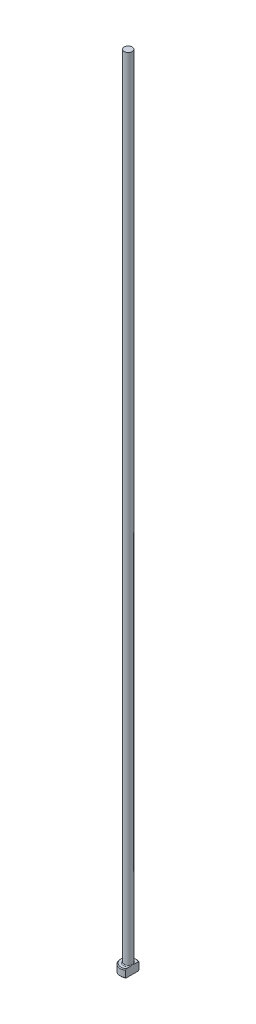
ISO-10303-21;
HEADER;
FILE_DESCRIPTION(('STEP AP214'),'2;1');
FILE_NAME('part.step','',(''),(''),'','','');
FILE_SCHEMA(('AUTOMOTIVE_DESIGN { 1 0 10303 214 1 1 1 1 }'));
ENDSEC;
DATA;
#1=APPLICATION_CONTEXT('core data for automotive mechanical design processes');
#2=APPLICATION_PROTOCOL_DEFINITION('international standard','automotive_design',2000,#1);
#3=PRODUCT_CONTEXT('',#1,'mechanical');
#4=PRODUCT('Part','Part','',(#3));
#5=PRODUCT_RELATED_PRODUCT_CATEGORY('part','',(#4));
#6=PRODUCT_DEFINITION_FORMATION('','',#4);
#7=PRODUCT_DEFINITION_CONTEXT('part definition',#1,'design');
#8=PRODUCT_DEFINITION('design','',#6,#7);
#9=PRODUCT_DEFINITION_SHAPE('','',#8);
#10=(LENGTH_UNIT() NAMED_UNIT(*) SI_UNIT(.MILLI.,.METRE.));
#11=(NAMED_UNIT(*) PLANE_ANGLE_UNIT() SI_UNIT($,.RADIAN.));
#12=(NAMED_UNIT(*) SI_UNIT($,.STERADIAN.) SOLID_ANGLE_UNIT());
#13=UNCERTAINTY_MEASURE_WITH_UNIT(LENGTH_MEASURE(1.E-05),#10,'distance_accuracy_value','');
#14=(GEOMETRIC_REPRESENTATION_CONTEXT(3) GLOBAL_UNCERTAINTY_ASSIGNED_CONTEXT((#13)) GLOBAL_UNIT_ASSIGNED_CONTEXT((#10,
#11,#12)) REPRESENTATION_CONTEXT('',''));
#15=CARTESIAN_POINT('',(0.,0.,0.));
#16=DIRECTION('',(0.,0.,1.));
#17=DIRECTION('',(1.,0.,0.));
#18=AXIS2_PLACEMENT_3D('',#15,#16,#17);
#19=CARTESIAN_POINT('',(0.,0.,0.));
#20=DIRECTION('',(0.,-1.,0.));
#21=DIRECTION('',(0.,0.,-1.));
#22=AXIS2_PLACEMENT_3D('',#19,#20,#21);
#23=PLANE('',#22);
#24=CARTESIAN_POINT('',(0.,0.,0.));
#25=DIRECTION('',(0.,-1.,0.));
#26=DIRECTION('',(0.,0.,-1.));
#27=AXIS2_PLACEMENT_3D('',#24,#25,#26);
#28=CIRCLE('',#27,1.8);
#29=CARTESIAN_POINT('',(0.999999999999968,0.,1.49666295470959));
#30=VERTEX_POINT('',#29);
#31=CARTESIAN_POINT('',(0.999999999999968,0.,-1.49666295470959));
#32=VERTEX_POINT('',#31);
#33=EDGE_CURVE('E98',#30,#32,#28,.T.);
#34=ORIENTED_EDGE('',*,*,#33,.T.);
#35=DIRECTION('',(0.,0.,1.));
#36=VECTOR('',#35,1.);
#37=CARTESIAN_POINT('',(0.999999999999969,0.,-1.73205080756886));
#38=LINE('',#37,#36);
#39=EDGE_CURVE('E83',#32,#30,#38,.T.);
#40=ORIENTED_EDGE('',*,*,#39,.T.);
#41=EDGE_LOOP('',(#34,#40));
#42=FACE_BOUND('',#41,.T.);
#43=ADVANCED_FACE('F32',(#42),#23,.T.);
#44=CARTESIAN_POINT('',(0.,259.958771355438,0.));
#45=DIRECTION('',(0.,1.,0.));
#46=DIRECTION('',(0.,0.,1.));
#47=AXIS2_PLACEMENT_3D('',#44,#45,#46);
#48=CYLINDRICAL_SURFACE('',#47,1.99999999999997);
#49=CARTESIAN_POINT('',(0.,1.80000000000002,0.));
#50=DIRECTION('',(0.,1.,0.));
#51=DIRECTION('',(0.,0.,1.));
#52=AXIS2_PLACEMENT_3D('',#49,#50,#51);
#53=CIRCLE('',#52,1.99999999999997);
#54=CARTESIAN_POINT('',(0.999999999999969,1.80000000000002,1.73205080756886));
#55=VERTEX_POINT('',#54);
#56=CARTESIAN_POINT('',(0.999999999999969,1.80000000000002,-1.73205080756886));
#57=VERTEX_POINT('',#56);
#58=EDGE_CURVE('E104',#55,#57,#53,.F.);
#59=ORIENTED_EDGE('',*,*,#58,.T.);
#60=DIRECTION('',(0.,-1.,0.));
#61=VECTOR('',#60,1.);
#62=CARTESIAN_POINT('',(0.999999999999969,200.,-1.73205080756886));
#63=LINE('',#62,#61);
#64=CARTESIAN_POINT('',(0.999999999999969,0.199999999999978,-1.73205080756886));
#65=VERTEX_POINT('',#64);
#66=EDGE_CURVE('E183',#57,#65,#63,.T.);
#67=ORIENTED_EDGE('',*,*,#66,.T.);
#68=CARTESIAN_POINT('',(0.,0.199999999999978,0.));
#69=DIRECTION('',(0.,-1.,0.));
#70=DIRECTION('',(0.,0.,-1.));
#71=AXIS2_PLACEMENT_3D('',#68,#69,#70);
#72=CIRCLE('',#71,1.99999999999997);
#73=CARTESIAN_POINT('',(0.999999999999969,0.199999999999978,1.73205080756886));
#74=VERTEX_POINT('',#73);
#75=EDGE_CURVE('E100',#65,#74,#72,.F.);
#76=ORIENTED_EDGE('',*,*,#75,.T.);
#77=DIRECTION('',(0.,-1.,0.));
#78=VECTOR('',#77,1.);
#79=CARTESIAN_POINT('',(0.999999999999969,200.,1.73205080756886));
#80=LINE('',#79,#78);
#81=EDGE_CURVE('E93',#55,#74,#80,.T.);
#82=ORIENTED_EDGE('',*,*,#81,.F.);
#83=EDGE_LOOP('',(#59,#67,#76,#82));
#84=FACE_BOUND('',#83,.T.);
#85=ADVANCED_FACE('F158',(#84),#48,.T.);
#86=CARTESIAN_POINT('',(-1.99999999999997,2.,0.));
#87=DIRECTION('',(0.,1.,0.));
#88=DIRECTION('',(0.,0.,1.));
#89=AXIS2_PLACEMENT_3D('',#86,#87,#88);
#90=PLANE('',#89);
#91=CARTESIAN_POINT('',(0.,2.,0.));
#92=DIRECTION('',(0.,1.,0.));
#93=DIRECTION('',(0.,0.,1.));
#94=AXIS2_PLACEMENT_3D('',#91,#92,#93);
#95=CIRCLE('',#94,1.8);
#96=CARTESIAN_POINT('',(0.999999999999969,2.,-1.4966629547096));
#97=VERTEX_POINT('',#96);
#98=CARTESIAN_POINT('',(0.999999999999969,2.,1.4966629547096));
#99=VERTEX_POINT('',#98);
#100=EDGE_CURVE('E178',#97,#99,#95,.T.);
#101=ORIENTED_EDGE('',*,*,#100,.T.);
#102=DIRECTION('',(0.,0.,-1.));
#103=VECTOR('',#102,1.);
#104=CARTESIAN_POINT('',(0.999999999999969,2.,0.));
#105=LINE('',#104,#103);
#106=CARTESIAN_POINT('',(0.999999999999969,1.99999999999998,0.66332495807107));
#107=VERTEX_POINT('',#106);
#108=EDGE_CURVE('E57',#99,#107,#105,.T.);
#109=ORIENTED_EDGE('',*,*,#108,.T.);
#110=CARTESIAN_POINT('',(0.,2.,0.));
#111=DIRECTION('',(0.,1.,0.));
#112=DIRECTION('',(0.,0.,1.));
#113=AXIS2_PLACEMENT_3D('',#110,#111,#112);
#114=CIRCLE('',#113,1.19999999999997);
#115=CARTESIAN_POINT('',(0.999999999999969,1.99999999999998,-0.663324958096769));
#116=VERTEX_POINT('',#115);
#117=EDGE_CURVE('E107',#107,#116,#114,.F.);
#118=ORIENTED_EDGE('',*,*,#117,.T.);
#119=EDGE_CURVE('E136',#116,#97,#105,.T.);
#120=ORIENTED_EDGE('',*,*,#119,.T.);
#121=EDGE_LOOP('',(#101,#109,#118,#120));
#122=FACE_BOUND('',#121,.T.);
#123=ADVANCED_FACE('F147',(#122),#90,.T.);
#124=CARTESIAN_POINT('',(0.,2.,0.));
#125=DIRECTION('',(0.,-1.,0.));
#126=DIRECTION('',(0.,0.,-1.));
#127=AXIS2_PLACEMENT_3D('',#124,#125,#126);
#128=CONICAL_SURFACE('',#127,1.8,0.785398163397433);
#129=ORIENTED_EDGE('',*,*,#58,.F.);
#130=CARTESIAN_POINT('',(0.999999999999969,-0.143084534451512,3.81417299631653));
#131=CARTESIAN_POINT('',(0.999999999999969,-0.0593997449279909,3.72765647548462));
#132=CARTESIAN_POINT('',(0.999999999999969,0.0241940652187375,3.64105173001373));
#133=CARTESIAN_POINT('',(0.999999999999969,0.191148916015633,3.46761616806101));
#134=CARTESIAN_POINT('',(0.999999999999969,0.274509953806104,3.38078534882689));
#135=CARTESIAN_POINT('',(0.999999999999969,0.524249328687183,3.11979400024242));
#136=CARTESIAN_POINT('',(0.999999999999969,0.690198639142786,2.94522254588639));
#137=CARTESIAN_POINT('',(0.999999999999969,1.016975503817,2.59782670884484));
#138=CARTESIAN_POINT('',(0.999999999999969,1.17783928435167,2.42503661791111));
#139=CARTESIAN_POINT('',(0.999999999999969,1.41669118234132,2.16364984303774));
#140=CARTESIAN_POINT('',(0.999999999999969,1.49589273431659,2.07616357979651));
#141=CARTESIAN_POINT('',(0.999999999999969,1.65313803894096,1.90015721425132));
#142=CARTESIAN_POINT('',(0.999999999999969,1.73118183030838,1.81163714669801));
#143=CARTESIAN_POINT('',(0.999999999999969,1.85567318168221,1.66767927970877));
#144=CARTESIAN_POINT('',(0.999999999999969,1.90265415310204,1.61270332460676));
#145=CARTESIAN_POINT('',(0.999999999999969,1.99577882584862,1.50203557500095));
#146=CARTESIAN_POINT('',(0.999999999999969,2.04192244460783,1.44634371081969));
#147=CARTESIAN_POINT('',(0.999999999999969,2.1335659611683,1.33345480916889));
#148=CARTESIAN_POINT('',(0.999999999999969,2.17905399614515,1.2762481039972));
#149=CARTESIAN_POINT('',(0.999999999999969,2.26844283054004,1.16060976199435));
#150=CARTESIAN_POINT('',(0.999999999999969,2.31234379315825,1.10217825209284));
#151=CARTESIAN_POINT('',(0.999999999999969,2.39853453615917,0.982773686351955));
#152=CARTESIAN_POINT('',(0.999999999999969,2.44078986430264,0.921775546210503));
#153=CARTESIAN_POINT('',(0.999999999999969,2.52187810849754,0.797387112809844));
#154=CARTESIAN_POINT('',(0.999999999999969,2.56070631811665,0.733993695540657));
#155=CARTESIAN_POINT('',(0.999999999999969,2.63248592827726,0.604932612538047));
#156=CARTESIAN_POINT('',(0.999999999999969,2.66550424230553,0.539302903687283));
#157=CARTESIAN_POINT('',(0.999999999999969,2.72301550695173,0.404437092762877));
#158=CARTESIAN_POINT('',(0.999999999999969,2.74753707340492,0.335214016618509));
#159=CARTESIAN_POINT('',(0.999999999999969,2.77407110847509,0.231400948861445));
#160=CARTESIAN_POINT('',(0.999999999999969,2.7811074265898,0.198093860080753));
#161=CARTESIAN_POINT('',(0.999999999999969,2.79200506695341,0.130954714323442));
#162=CARTESIAN_POINT('',(0.999999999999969,2.79586666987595,0.0971227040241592));
#163=CARTESIAN_POINT('',(0.999999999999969,2.8001390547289,0.0293410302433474));
#164=CARTESIAN_POINT('',(0.999999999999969,2.80056046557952,-0.00460794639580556));
#165=CARTESIAN_POINT('',(0.999999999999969,2.79795882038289,-0.0723663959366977));
#166=CARTESIAN_POINT('',(0.999999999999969,2.79493547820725,-0.106175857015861));
#167=CARTESIAN_POINT('',(0.999999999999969,2.78105481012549,-0.206326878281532));
#168=CARTESIAN_POINT('',(0.999999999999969,2.7654214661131,-0.272037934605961));
#169=CARTESIAN_POINT('',(0.999999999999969,2.73477554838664,-0.368312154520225));
#170=CARTESIAN_POINT('',(0.999999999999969,2.72331063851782,-0.40012349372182));
#171=CARTESIAN_POINT('',(0.999999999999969,2.69840546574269,-0.46296441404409));
#172=CARTESIAN_POINT('',(0.999999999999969,2.68496560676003,-0.493994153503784));
#173=CARTESIAN_POINT('',(0.999999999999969,2.64209309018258,-0.586298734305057));
#174=CARTESIAN_POINT('',(0.999999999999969,2.61022871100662,-0.64643570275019));
#175=CARTESIAN_POINT('',(0.999999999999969,2.54228534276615,-0.764304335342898));
#176=CARTESIAN_POINT('',(0.999999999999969,2.50620119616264,-0.8220329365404));
#177=CARTESIAN_POINT('',(0.999999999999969,2.43107084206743,-0.935840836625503));
#178=CARTESIAN_POINT('',(0.999999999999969,2.39201347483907,-0.991912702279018));
#179=CARTESIAN_POINT('',(0.999999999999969,2.31195870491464,-1.10259849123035));
#180=CARTESIAN_POINT('',(0.999999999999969,2.27096226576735,-1.15721311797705));
#181=CARTESIAN_POINT('',(0.999999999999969,2.18701695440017,-1.26606869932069));
#182=CARTESIAN_POINT('',(0.999999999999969,2.14404946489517,-1.32029522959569));
#183=CARTESIAN_POINT('',(0.999999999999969,2.05705050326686,-1.4278898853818));
#184=CARTESIAN_POINT('',(0.999999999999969,2.01301896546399,-1.48125795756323));
#185=CARTESIAN_POINT('',(0.999999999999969,1.87995068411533,-1.64010952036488));
#186=CARTESIAN_POINT('',(0.999999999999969,1.78973357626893,-1.74460261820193));
#187=CARTESIAN_POINT('',(0.999999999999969,1.62290341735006,-1.93426834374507));
#188=CARTESIAN_POINT('',(0.999999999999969,1.54658658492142,-2.01970404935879));
#189=CARTESIAN_POINT('',(0.999999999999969,1.39301250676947,-2.18973019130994));
#190=CARTESIAN_POINT('',(0.999999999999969,1.31575523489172,-2.27432060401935));
#191=CARTESIAN_POINT('',(0.999999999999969,1.08283440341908,-2.52732479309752));
#192=CARTESIAN_POINT('',(0.999999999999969,0.926165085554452,-2.69481086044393));
#193=CARTESIAN_POINT('',(0.999999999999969,0.617772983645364,-3.02147252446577));
#194=CARTESIAN_POINT('',(0.999999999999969,0.466111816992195,-3.18070657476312));
#195=CARTESIAN_POINT('',(0.999999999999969,0.238015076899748,-3.41880818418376));
#196=CARTESIAN_POINT('',(0.999999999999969,0.161924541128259,-3.49800657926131));
#197=CARTESIAN_POINT('',(0.999999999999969,0.00955322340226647,-3.65621892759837));
#198=CARTESIAN_POINT('',(0.999999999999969,-0.0667275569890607,-3.73523288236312));
#199=CARTESIAN_POINT('',(0.999999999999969,-0.143084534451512,-3.81417299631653));
#200=B_SPLINE_CURVE_WITH_KNOTS('',3,(#130,#131,#132,#133,#134,#135,#136,#137,#138,#139,#140,
#141,#142,#143,#144,#145,#146,#147,#148,#149,#150,#151,#152,#153,#154,#155,#156,#157,#158,#159,
#160,#161,#162,#163,#164,#165,#166,#167,#168,#169,#170,#171,#172,#173,#174,#175,#176,#177,#178,
#179,#180,#181,#182,#183,#184,#185,#186,#187,#188,#189,#190,#191,#192,#193,#194,#195,#196,#197,
#198,#199),.UNSPECIFIED.,.F.,.F.,(4,2,2,2,2,2,2,2,2,2,2,2,2,2,2,2,2,2,2,2,2,2,2,2,2,2,2,2,2,2,2,
2,2,2,4),(0.,0.361101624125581,0.722207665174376,1.44478731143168,2.15299784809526,
2.5070263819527,2.8610430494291,3.07798416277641,3.29494655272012,3.51418925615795,
3.73340935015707,3.95594813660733,4.17878792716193,4.39886399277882,4.61819150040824,
4.72018864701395,4.82217677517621,4.92384967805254,5.02553102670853,5.22698459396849,
5.32838854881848,5.4297717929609,5.63365200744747,5.837784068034,6.04272417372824,
6.24756349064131,6.45510395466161,6.66265726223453,7.07676259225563,7.42043039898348,
7.7641077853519,8.45210822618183,9.1118082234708,9.44129145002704,9.77077197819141),.UNSPECIFIED.);
#201=EDGE_CURVE('E135',#55,#99,#200,.T.);
#202=ORIENTED_EDGE('',*,*,#201,.T.);
#203=ORIENTED_EDGE('',*,*,#100,.F.);
#204=EDGE_CURVE('E127',#97,#57,#200,.T.);
#205=ORIENTED_EDGE('',*,*,#204,.T.);
#206=EDGE_LOOP('',(#129,#202,#203,#205));
#207=FACE_BOUND('',#206,.T.);
#208=ADVANCED_FACE('F143',(#207),#128,.T.);
#209=CARTESIAN_POINT('',(0.,0.199999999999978,0.));
#210=DIRECTION('',(0.,1.,0.));
#211=DIRECTION('',(0.,0.,1.));
#212=AXIS2_PLACEMENT_3D('',#209,#210,#211);
#213=CONICAL_SURFACE('',#212,1.99999999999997,0.785398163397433);
#214=ORIENTED_EDGE('',*,*,#75,.F.);
#215=CARTESIAN_POINT('',(0.999999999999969,2.14308453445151,-3.81417299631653));
#216=CARTESIAN_POINT('',(0.999999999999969,2.05939974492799,-3.72765647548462));
#217=CARTESIAN_POINT('',(0.999999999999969,1.97580593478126,-3.64105173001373));
#218=CARTESIAN_POINT('',(0.999999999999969,1.80885108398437,-3.46761616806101));
#219=CARTESIAN_POINT('',(0.999999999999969,1.7254900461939,-3.38078534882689));
#220=CARTESIAN_POINT('',(0.999999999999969,1.47575067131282,-3.11979400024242));
#221=CARTESIAN_POINT('',(0.999999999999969,1.30980136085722,-2.94522254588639));
#222=CARTESIAN_POINT('',(0.999999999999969,0.983024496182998,-2.59782670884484));
#223=CARTESIAN_POINT('',(0.999999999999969,0.822160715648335,-2.42503661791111));
#224=CARTESIAN_POINT('',(0.999999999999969,0.583308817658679,-2.16364984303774));
#225=CARTESIAN_POINT('',(0.999999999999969,0.504107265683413,-2.07616357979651));
#226=CARTESIAN_POINT('',(0.999999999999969,0.346861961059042,-1.90015721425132));
#227=CARTESIAN_POINT('',(0.999999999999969,0.268818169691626,-1.81163714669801));
#228=CARTESIAN_POINT('',(0.999999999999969,0.144326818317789,-1.66767927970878));
#229=CARTESIAN_POINT('',(0.999999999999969,0.0973458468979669,-1.61270332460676));
#230=CARTESIAN_POINT('',(0.999999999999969,0.00422117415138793,-1.50203557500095));
#231=CARTESIAN_POINT('',(0.999999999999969,-0.0419224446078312,-1.44634371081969));
#232=CARTESIAN_POINT('',(0.999999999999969,-0.133565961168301,-1.3334548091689));
#233=CARTESIAN_POINT('',(0.999999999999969,-0.179053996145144,-1.2762481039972));
#234=CARTESIAN_POINT('',(0.999999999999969,-0.268442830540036,-1.16060976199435));
#235=CARTESIAN_POINT('',(0.999999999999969,-0.312343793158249,-1.10217825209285));
#236=CARTESIAN_POINT('',(0.999999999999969,-0.398534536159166,-0.982773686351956));
#237=CARTESIAN_POINT('',(0.999999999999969,-0.440789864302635,-0.921775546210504));
#238=CARTESIAN_POINT('',(0.999999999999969,-0.521878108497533,-0.797387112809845));
#239=CARTESIAN_POINT('',(0.999999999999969,-0.560706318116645,-0.733993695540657));
#240=CARTESIAN_POINT('',(0.999999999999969,-0.632485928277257,-0.604932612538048));
#241=CARTESIAN_POINT('',(0.999999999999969,-0.665504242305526,-0.539302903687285));
#242=CARTESIAN_POINT('',(0.999999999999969,-0.723015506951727,-0.404437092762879));
#243=CARTESIAN_POINT('',(0.999999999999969,-0.747537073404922,-0.33521401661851));
#244=CARTESIAN_POINT('',(0.999999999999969,-0.774071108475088,-0.231400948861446));
#245=CARTESIAN_POINT('',(0.999999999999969,-0.781107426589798,-0.198093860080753));
#246=CARTESIAN_POINT('',(0.999999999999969,-0.792005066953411,-0.130954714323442));
#247=CARTESIAN_POINT('',(0.999999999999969,-0.795866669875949,-0.0971227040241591));
#248=CARTESIAN_POINT('',(0.999999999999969,-0.8001390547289,-0.0293410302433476));
#249=CARTESIAN_POINT('',(0.999999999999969,-0.800560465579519,0.00460794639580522));
#250=CARTESIAN_POINT('',(0.999999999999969,-0.797958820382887,0.0723663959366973));
#251=CARTESIAN_POINT('',(0.999999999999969,-0.794935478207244,0.106175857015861));
#252=CARTESIAN_POINT('',(0.999999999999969,-0.78105481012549,0.206326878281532));
#253=CARTESIAN_POINT('',(0.999999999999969,-0.765421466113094,0.272037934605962));
#254=CARTESIAN_POINT('',(0.999999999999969,-0.734775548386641,0.368312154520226));
#255=CARTESIAN_POINT('',(0.999999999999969,-0.723310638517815,0.400123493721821));
#256=CARTESIAN_POINT('',(0.999999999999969,-0.698405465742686,0.46296441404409));
#257=CARTESIAN_POINT('',(0.999999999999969,-0.684965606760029,0.493994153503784));
#258=CARTESIAN_POINT('',(0.999999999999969,-0.642093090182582,0.586298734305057));
#259=CARTESIAN_POINT('',(0.999999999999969,-0.610228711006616,0.64643570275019));
#260=CARTESIAN_POINT('',(0.999999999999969,-0.542285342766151,0.764304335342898));
#261=CARTESIAN_POINT('',(0.999999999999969,-0.506201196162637,0.8220329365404));
#262=CARTESIAN_POINT('',(0.999999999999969,-0.431070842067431,0.935840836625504));
#263=CARTESIAN_POINT('',(0.999999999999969,-0.392013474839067,0.991912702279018));
#264=CARTESIAN_POINT('',(0.999999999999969,-0.311958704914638,1.10259849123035));
#265=CARTESIAN_POINT('',(0.999999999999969,-0.270962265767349,1.15721311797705));
#266=CARTESIAN_POINT('',(0.999999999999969,-0.187016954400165,1.26606869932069));
#267=CARTESIAN_POINT('',(0.999999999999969,-0.144049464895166,1.32029522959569));
#268=CARTESIAN_POINT('',(0.999999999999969,-0.0570505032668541,1.4278898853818));
#269=CARTESIAN_POINT('',(0.999999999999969,-0.0130189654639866,1.48125795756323));
#270=CARTESIAN_POINT('',(0.999999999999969,0.120049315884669,1.64010952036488));
#271=CARTESIAN_POINT('',(0.999999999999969,0.210266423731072,1.74460261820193));
#272=CARTESIAN_POINT('',(0.999999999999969,0.377096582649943,1.93426834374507));
#273=CARTESIAN_POINT('',(0.999999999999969,0.453413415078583,2.01970404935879));
#274=CARTESIAN_POINT('',(0.999999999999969,0.60698749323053,2.18973019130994));
#275=CARTESIAN_POINT('',(0.999999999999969,0.684244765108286,2.27432060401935));
#276=CARTESIAN_POINT('',(0.999999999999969,0.917165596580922,2.52732479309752));
#277=CARTESIAN_POINT('',(0.999999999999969,1.07383491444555,2.69481086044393));
#278=CARTESIAN_POINT('',(0.999999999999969,1.38222701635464,3.02147252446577));
#279=CARTESIAN_POINT('',(0.999999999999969,1.53388818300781,3.18070657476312));
#280=CARTESIAN_POINT('',(0.999999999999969,1.76198492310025,3.41880818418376));
#281=CARTESIAN_POINT('',(0.999999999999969,1.83807545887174,3.49800657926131));
#282=CARTESIAN_POINT('',(0.999999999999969,1.99044677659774,3.65621892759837));
#283=CARTESIAN_POINT('',(0.999999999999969,2.06672755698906,3.73523288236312));
#284=CARTESIAN_POINT('',(0.999999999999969,2.14308453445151,3.81417299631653));
#285=B_SPLINE_CURVE_WITH_KNOTS('',3,(#215,#216,#217,#218,#219,#220,#221,#222,#223,#224,#225,
#226,#227,#228,#229,#230,#231,#232,#233,#234,#235,#236,#237,#238,#239,#240,#241,#242,#243,#244,
#245,#246,#247,#248,#249,#250,#251,#252,#253,#254,#255,#256,#257,#258,#259,#260,#261,#262,#263,
#264,#265,#266,#267,#268,#269,#270,#271,#272,#273,#274,#275,#276,#277,#278,#279,#280,#281,#282,
#283,#284),.UNSPECIFIED.,.F.,.F.,(4,2,2,2,2,2,2,2,2,2,2,2,2,2,2,2,2,2,2,2,2,2,2,2,2,2,2,2,2,2,2,
2,2,2,4),(0.,0.36110162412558,0.722207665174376,1.44478731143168,2.15299784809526,
2.5070263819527,2.8610430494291,3.07798416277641,3.29494655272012,3.51418925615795,
3.73340935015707,3.95594813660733,4.17878792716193,4.39886399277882,4.61819150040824,
4.72018864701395,4.82217677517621,4.92384967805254,5.02553102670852,5.22698459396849,
5.32838854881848,5.42977179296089,5.63365200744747,5.83778406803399,6.04272417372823,
6.24756349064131,6.45510395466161,6.66265726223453,7.07676259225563,7.42043039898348,
7.7641077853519,8.45210822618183,9.1118082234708,9.44129145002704,9.77077197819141),.UNSPECIFIED.);
#286=EDGE_CURVE('E86',#65,#32,#285,.T.);
#287=ORIENTED_EDGE('',*,*,#286,.T.);
#288=ORIENTED_EDGE('',*,*,#33,.F.);
#289=EDGE_CURVE('E89',#30,#74,#285,.T.);
#290=ORIENTED_EDGE('',*,*,#289,.T.);
#291=EDGE_LOOP('',(#214,#287,#288,#290));
#292=FACE_BOUND('',#291,.T.);
#293=ADVANCED_FACE('F97',(#292),#213,.T.);
#294=CARTESIAN_POINT('',(0.,2.19999999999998,0.));
#295=DIRECTION('',(0.,1.,0.));
#296=DIRECTION('',(0.,0.,1.));
#297=AXIS2_PLACEMENT_3D('',#294,#295,#296);
#298=TOROIDAL_SURFACE('',#297,1.19999999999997,0.2);
#299=CARTESIAN_POINT('',(0.999999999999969,2.19999999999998,0.));
#300=CARTESIAN_POINT('',(0.999999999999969,2.20000051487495,2.59081815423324E-12));
#301=CARTESIAN_POINT('',(0.999999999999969,2.20000102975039,-9.42496323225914E-08));
#302=CARTESIAN_POINT('',(0.999999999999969,2.20000202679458,-4.00799840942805E-07));
#303=CARTESIAN_POINT('',(0.999999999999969,2.20000250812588,-6.15372267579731E-07));
#304=CARTESIAN_POINT('',(0.999999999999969,2.20000346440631,-1.13351400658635E-06));
#305=CARTESIAN_POINT('',(0.999999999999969,2.20000393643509,-1.44235223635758E-06));
#306=CARTESIAN_POINT('',(0.999999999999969,2.20000483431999,-2.11388874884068E-06));
#307=CARTESIAN_POINT('',(0.999999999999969,2.20000526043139,-2.47625950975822E-06));
#308=CARTESIAN_POINT('',(0.999999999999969,2.20000666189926,-3.75794155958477E-06));
#309=CARTESIAN_POINT('',(0.999999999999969,2.20000757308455,-4.74818954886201E-06));
#310=CARTESIAN_POINT('',(0.999999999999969,2.2000092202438,-6.81289830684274E-06));
#311=CARTESIAN_POINT('',(0.999999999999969,2.20000996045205,-7.88417644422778E-06));
#312=CARTESIAN_POINT('',(0.999999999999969,2.20001267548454,-1.19907293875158E-05));
#313=CARTESIAN_POINT('',(0.999999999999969,2.20001450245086,-1.51274184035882E-05));
#314=CARTESIAN_POINT('',(0.999999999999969,2.20001755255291,-2.13715425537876E-05));
#315=CARTESIAN_POINT('',(0.999999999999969,2.20001881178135,-2.44620176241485E-05));
#316=CARTESIAN_POINT('',(0.999999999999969,2.20002404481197,-3.74145208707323E-05));
#317=CARTESIAN_POINT('',(0.999999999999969,2.20002793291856,-4.73052124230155E-05));
#318=CARTESIAN_POINT('',(0.999999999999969,2.20003428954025,-6.59457074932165E-05));
#319=CARTESIAN_POINT('',(0.999999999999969,2.20003688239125,-7.46515299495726E-05));
#320=CARTESIAN_POINT('',(0.999999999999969,2.20005709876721,-0.000137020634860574));
#321=CARTESIAN_POINT('',(0.999999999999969,2.20008244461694,-0.000187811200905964));
#322=CARTESIAN_POINT('',(0.999999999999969,2.2001767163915,-0.00038404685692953));
#323=CARTESIAN_POINT('',(0.999999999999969,2.20023990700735,-0.000531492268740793));
#324=CARTESIAN_POINT('',(0.999999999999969,2.20048701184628,-0.00109942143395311));
#325=CARTESIAN_POINT('',(0.999999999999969,2.20067693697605,-0.00151784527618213));
#326=CARTESIAN_POINT('',(0.999999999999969,2.20144296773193,-0.00321386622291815));
#327=CARTESIAN_POINT('',(0.999999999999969,2.20201230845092,-0.00449374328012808));
#328=CARTESIAN_POINT('',(0.999999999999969,2.20998444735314,-0.0224047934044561));
#329=CARTESIAN_POINT('',(0.999999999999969,2.21743524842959,-0.0390202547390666));
#330=CARTESIAN_POINT('',(0.999999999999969,2.23197002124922,-0.0717084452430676));
#331=CARTESIAN_POINT('',(0.999999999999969,2.23905766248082,-0.0877796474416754));
#332=CARTESIAN_POINT('',(0.999999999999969,2.25389009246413,-0.121781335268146));
#333=CARTESIAN_POINT('',(0.999999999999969,2.26161964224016,-0.139718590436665));
#334=CARTESIAN_POINT('',(0.999999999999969,2.27689168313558,-0.175878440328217));
#335=CARTESIAN_POINT('',(0.999999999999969,2.28443162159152,-0.194102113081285));
#336=CARTESIAN_POINT('',(0.999999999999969,2.30282726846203,-0.239840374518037));
#337=CARTESIAN_POINT('',(0.999999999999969,2.31345710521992,-0.267447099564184));
#338=CARTESIAN_POINT('',(0.999999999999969,2.33331094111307,-0.322481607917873));
#339=CARTESIAN_POINT('',(0.999999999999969,2.34256072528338,-0.349899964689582));
#340=CARTESIAN_POINT('',(0.999999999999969,2.35732089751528,-0.398044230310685));
#341=CARTESIAN_POINT('',(0.999999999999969,2.36317895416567,-0.41866173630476));
#342=CARTESIAN_POINT('',(0.999999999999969,2.37387907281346,-0.460275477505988));
#343=CARTESIAN_POINT('',(0.999999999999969,2.37871519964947,-0.481273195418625));
#344=CARTESIAN_POINT('',(0.999999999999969,2.39174175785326,-0.546853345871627));
#345=CARTESIAN_POINT('',(0.999999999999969,2.39776253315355,-0.591947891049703));
#346=CARTESIAN_POINT('',(0.999999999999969,2.40040174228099,-0.660990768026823));
#347=CARTESIAN_POINT('',(0.999999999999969,2.400126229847,-0.684818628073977));
#348=CARTESIAN_POINT('',(0.999999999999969,2.39660783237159,-0.732027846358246));
#349=CARTESIAN_POINT('',(0.999999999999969,2.39339826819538,-0.755411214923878));
#350=CARTESIAN_POINT('',(0.999999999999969,2.38447874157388,-0.796083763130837));
#351=CARTESIAN_POINT('',(0.999999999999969,2.37951676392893,-0.813533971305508));
#352=CARTESIAN_POINT('',(0.999999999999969,2.36698902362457,-0.847531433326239));
#353=CARTESIAN_POINT('',(0.999999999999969,2.35942232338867,-0.864078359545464));
#354=CARTESIAN_POINT('',(0.999999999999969,2.34431787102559,-0.890141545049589));
#355=CARTESIAN_POINT('',(0.999999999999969,2.33762931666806,-0.900148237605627));
#356=CARTESIAN_POINT('',(0.999999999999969,2.32281345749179,-0.9190336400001));
#357=CARTESIAN_POINT('',(0.999999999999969,2.3146887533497,-0.927914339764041));
#358=CARTESIAN_POINT('',(0.999999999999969,2.29878569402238,-0.942427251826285));
#359=CARTESIAN_POINT('',(0.999999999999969,2.29127620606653,-0.948352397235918));
#360=CARTESIAN_POINT('',(0.999999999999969,2.27538509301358,-0.958904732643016));
#361=CARTESIAN_POINT('',(0.999999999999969,2.26700378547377,-0.963532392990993));
#362=CARTESIAN_POINT('',(0.999999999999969,2.24944905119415,-0.971220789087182));
#363=CARTESIAN_POINT('',(0.999999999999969,2.24026913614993,-0.974266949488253));
#364=CARTESIAN_POINT('',(0.999999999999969,2.22148612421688,-0.978466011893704));
#365=CARTESIAN_POINT('',(0.999999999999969,2.21188346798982,-0.979620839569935));
#366=CARTESIAN_POINT('',(0.999999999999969,2.19406751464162,-0.979911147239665));
#367=CARTESIAN_POINT('',(0.999999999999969,2.18585759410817,-0.979318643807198));
#368=CARTESIAN_POINT('',(0.999999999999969,2.16966497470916,-0.976727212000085));
#369=CARTESIAN_POINT('',(0.999999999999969,2.16168225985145,-0.974728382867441));
#370=CARTESIAN_POINT('',(0.999999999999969,2.14632905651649,-0.969513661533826));
#371=CARTESIAN_POINT('',(0.999999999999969,2.13894889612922,-0.966325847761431));
#372=CARTESIAN_POINT('',(0.999999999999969,2.12474145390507,-0.958901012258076));
#373=CARTESIAN_POINT('',(0.999999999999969,2.11791436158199,-0.954663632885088));
#374=CARTESIAN_POINT('',(0.999999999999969,2.10210888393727,-0.94332347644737));
#375=CARTESIAN_POINT('',(0.999999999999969,2.09345388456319,-0.935769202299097));
#376=CARTESIAN_POINT('',(0.999999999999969,2.07747441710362,-0.919359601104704));
#377=CARTESIAN_POINT('',(0.999999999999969,2.07015330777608,-0.910501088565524));
#378=CARTESIAN_POINT('',(0.999999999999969,2.05394486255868,-0.887884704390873));
#379=CARTESIAN_POINT('',(0.999999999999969,2.04572469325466,-0.873650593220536));
#380=CARTESIAN_POINT('',(0.999999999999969,2.03162462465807,-0.844119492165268));
#381=CARTESIAN_POINT('',(0.999999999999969,2.02574383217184,-0.828822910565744));
#382=CARTESIAN_POINT('',(0.999999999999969,2.01314628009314,-0.788605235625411));
#383=CARTESIAN_POINT('',(0.999999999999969,2.00790637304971,-0.763225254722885));
#384=CARTESIAN_POINT('',(0.999999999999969,2.00123778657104,-0.711706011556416));
#385=CARTESIAN_POINT('',(0.999999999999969,1.99986086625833,-0.685561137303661));
#386=CARTESIAN_POINT('',(0.999999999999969,2.00029138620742,-0.610897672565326));
#387=CARTESIAN_POINT('',(0.999999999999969,2.00583944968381,-0.56240829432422));
#388=CARTESIAN_POINT('',(0.999999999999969,2.01894675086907,-0.492015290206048));
#389=CARTESIAN_POINT('',(0.999999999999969,2.02392178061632,-0.469516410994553));
#390=CARTESIAN_POINT('',(0.999999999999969,2.03507986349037,-0.424950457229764));
#391=CARTESIAN_POINT('',(0.999999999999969,2.04125559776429,-0.402881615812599));
#392=CARTESIAN_POINT('',(0.999999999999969,2.05640318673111,-0.35306390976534));
#393=CARTESIAN_POINT('',(0.999999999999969,2.06567810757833,-0.325409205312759));
#394=CARTESIAN_POINT('',(0.999999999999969,2.08561584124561,-0.26990072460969));
#395=CARTESIAN_POINT('',(0.999999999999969,2.09630536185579,-0.242056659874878));
#396=CARTESIAN_POINT('',(0.999999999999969,2.11482832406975,-0.195905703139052));
#397=CARTESIAN_POINT('',(0.999999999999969,2.12243033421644,-0.177504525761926));
#398=CARTESIAN_POINT('',(0.999999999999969,2.13783353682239,-0.140994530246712));
#399=CARTESIAN_POINT('',(0.999999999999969,2.14563210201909,-0.122884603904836));
#400=CARTESIAN_POINT('',(0.999999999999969,2.16059970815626,-0.0885577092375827));
#401=CARTESIAN_POINT('',(0.999999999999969,2.1677530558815,-0.0723337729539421));
#402=CARTESIAN_POINT('',(0.999999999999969,2.18242403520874,-0.0393353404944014));
#403=CARTESIAN_POINT('',(0.999999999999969,2.18994542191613,-0.0225624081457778));
#404=CARTESIAN_POINT('',(0.999999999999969,2.19798770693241,-0.00449370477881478));
#405=CARTESIAN_POINT('',(0.999999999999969,2.1985570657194,-0.00321379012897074));
#406=CARTESIAN_POINT('',(0.999999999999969,2.19932310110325,-0.00151776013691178));
#407=CARTESIAN_POINT('',(0.999999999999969,2.19951301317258,-0.00109936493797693));
#408=CARTESIAN_POINT('',(0.999999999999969,2.19976010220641,-0.000531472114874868));
#409=CARTESIAN_POINT('',(0.999999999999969,2.19982328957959,-0.000384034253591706));
#410=CARTESIAN_POINT('',(0.999999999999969,2.19991755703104,-0.000187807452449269));
#411=CARTESIAN_POINT('',(0.999999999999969,2.1999429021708,-0.000137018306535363));
#412=CARTESIAN_POINT('',(0.999999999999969,2.19996311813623,-7.46508462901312E-05));
#413=CARTESIAN_POINT('',(0.999999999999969,2.19996571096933,-6.59451379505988E-05));
#414=CARTESIAN_POINT('',(0.999999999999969,2.19997206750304,-4.73048898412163E-05));
#415=CARTESIAN_POINT('',(0.999999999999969,2.19997595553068,-3.74143280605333E-05));
#416=CARTESIAN_POINT('',(0.999999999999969,2.19998118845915,-2.44619706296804E-05));
#417=CARTESIAN_POINT('',(0.999999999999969,2.19998244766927,-2.1371514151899E-05));
#418=CARTESIAN_POINT('',(0.999999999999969,2.19998549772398,-1.5127424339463E-05));
#419=CARTESIAN_POINT('',(0.999999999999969,2.19998732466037,-1.19907504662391E-05));
#420=CARTESIAN_POINT('',(0.999999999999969,2.19999003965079,-7.88421136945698E-06));
#421=CARTESIAN_POINT('',(0.999999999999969,2.19999077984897,-6.81293469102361E-06));
#422=CARTESIAN_POINT('',(0.999999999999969,2.19999242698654,-4.74822681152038E-06));
#423=CARTESIAN_POINT('',(0.999999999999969,2.19999333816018,-3.75797816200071E-06));
#424=CARTESIAN_POINT('',(0.999999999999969,2.1999947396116,-2.47629275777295E-06));
#425=CARTESIAN_POINT('',(0.999999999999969,2.19999516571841,-2.1139205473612E-06));
#426=CARTESIAN_POINT('',(0.999999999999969,2.19999606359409,-1.44238031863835E-06));
#427=CARTESIAN_POINT('',(0.999999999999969,2.19999653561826,-1.13353981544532E-06));
#428=CARTESIAN_POINT('',(0.999999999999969,2.19999749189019,-6.15392568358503E-07));
#429=CARTESIAN_POINT('',(0.999999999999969,2.1999979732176,-4.00816998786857E-07));
#430=CARTESIAN_POINT('',(0.999999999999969,2.19999897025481,-9.42592106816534E-08));
#431=CARTESIAN_POINT('',(0.999999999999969,2.19999948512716,-2.59080736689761E-12));
#432=CARTESIAN_POINT('',(0.999999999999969,2.19999999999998,0.));
#433=B_SPLINE_CURVE_WITH_KNOTS('',3,(#299,#300,#301,#302,#303,#304,#305,#306,#307,#308,#309,
#310,#311,#312,#313,#314,#315,#316,#317,#318,#319,#320,#321,#322,#323,#324,#325,#326,#327,#328,
#329,#330,#331,#332,#333,#334,#335,#336,#337,#338,#339,#340,#341,#342,#343,#344,#345,#346,#347,
#348,#349,#350,#351,#352,#353,#354,#355,#356,#357,#358,#359,#360,#361,#362,#363,#364,#365,#366,
#367,#368,#369,#370,#371,#372,#373,#374,#375,#376,#377,#378,#379,#380,#381,#382,#383,#384,#385,
#386,#387,#388,#389,#390,#391,#392,#393,#394,#395,#396,#397,#398,#399,#400,#401,#402,#403,#404,
#405,#406,#407,#408,#409,#410,#411,#412,#413,#414,#415,#416,#417,#418,#419,#420,#421,#422,#423,
#424,#425,#426,#427,#428,#429,#430,#431,#432),.UNSPECIFIED.,.T.,.F.,(4,2,2,2,2,2,2,2,2,2,2,2,2,
2,2,2,2,2,2,2,2,2,2,2,2,2,2,2,2,2,2,2,2,2,2,2,2,2,2,2,2,2,2,2,2,2,2,2,2,2,2,2,2,2,2,2,2,2,2,2,2,
2,2,2,2,2,4),(0.,1.54318097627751E-06,3.11656716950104E-06,4.80252031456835E-06,
6.47855575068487E-06,1.04956563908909E-05,1.43988918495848E-05,2.52504396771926E-05,
3.52518428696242E-05,6.71249461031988E-05,9.43496753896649E-05,0.000263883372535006,
0.000745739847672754,0.00212351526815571,0.00632669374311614,0.0609485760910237,
0.113643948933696,0.172237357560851,0.231401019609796,0.320129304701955,0.406905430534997,
0.471177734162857,0.53581363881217,0.671617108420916,0.742973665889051,0.813529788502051,
0.867802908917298,0.922095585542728,0.958095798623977,0.994031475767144,1.02261929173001,
1.05119673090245,1.08003306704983,1.10884002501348,1.13341017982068,1.15797860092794,
1.18200020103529,1.20602999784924,1.24030227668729,1.27465969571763,1.32369575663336,
1.37271307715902,1.45002425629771,1.52836647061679,1.67385288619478,1.74297459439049,
1.81168748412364,1.89915940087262,1.9886152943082,2.04834216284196,2.10749314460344,
2.16068730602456,2.21582681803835,2.2200301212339,2.22140780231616,2.2218896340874,
2.22205916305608,2.22208638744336,2.22211826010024,2.22212826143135,2.22213911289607,
2.2221430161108,2.22214703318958,2.22214870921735,2.22215039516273,2.22215196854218,
2.22215351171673),.UNSPECIFIED.);
#434=CARTESIAN_POINT('',(0.999999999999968,2.19999999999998,0.));
#435=VERTEX_POINT('',#434);
#436=EDGE_CURVE('E11',#116,#435,#433,.T.);
#437=ORIENTED_EDGE('',*,*,#436,.F.);
#438=ORIENTED_EDGE('',*,*,#117,.F.);
#439=CARTESIAN_POINT('',(0.999999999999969,2.19999999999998,0.));
#440=CARTESIAN_POINT('',(0.999999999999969,2.19999948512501,-2.59088640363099E-12));
#441=CARTESIAN_POINT('',(0.999999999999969,2.19999897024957,9.42496322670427E-08));
#442=CARTESIAN_POINT('',(0.999999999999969,2.19999797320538,4.00799840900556E-07));
#443=CARTESIAN_POINT('',(0.999999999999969,2.19999749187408,6.15372267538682E-07));
#444=CARTESIAN_POINT('',(0.999999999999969,2.19999653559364,1.13351400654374E-06));
#445=CARTESIAN_POINT('',(0.999999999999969,2.19999606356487,1.44235223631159E-06));
#446=CARTESIAN_POINT('',(0.999999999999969,2.19999516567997,2.11388874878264E-06));
#447=CARTESIAN_POINT('',(0.999999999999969,2.19999473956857,2.47625950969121E-06));
#448=CARTESIAN_POINT('',(0.999999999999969,2.1999933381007,3.75794155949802E-06));
#449=CARTESIAN_POINT('',(0.999999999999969,2.19999242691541,4.74818954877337E-06));
#450=CARTESIAN_POINT('',(0.999999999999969,2.19999077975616,6.8128983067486E-06));
#451=CARTESIAN_POINT('',(0.999999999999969,2.19999003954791,7.88417644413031E-06));
#452=CARTESIAN_POINT('',(0.999999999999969,2.19998732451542,1.19907293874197E-05));
#453=CARTESIAN_POINT('',(0.999999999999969,2.1999854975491,1.51274184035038E-05));
#454=CARTESIAN_POINT('',(0.999999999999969,2.19998244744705,2.13715425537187E-05));
#455=CARTESIAN_POINT('',(0.999999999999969,2.19998118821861,2.44620176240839E-05));
#456=CARTESIAN_POINT('',(0.999999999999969,2.19997595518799,3.74145208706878E-05));
#457=CARTESIAN_POINT('',(0.999999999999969,2.1999720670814,4.73052124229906E-05));
#458=CARTESIAN_POINT('',(0.999999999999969,2.19996571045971,6.59457074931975E-05));
#459=CARTESIAN_POINT('',(0.999999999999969,2.19996311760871,7.46515299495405E-05));
#460=CARTESIAN_POINT('',(0.999999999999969,2.19994290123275,0.000137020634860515));
#461=CARTESIAN_POINT('',(0.999999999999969,2.19991755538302,0.000187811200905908));
#462=CARTESIAN_POINT('',(0.999999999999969,2.19982328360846,0.000384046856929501));
#463=CARTESIAN_POINT('',(0.999999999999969,2.19976009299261,0.000531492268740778));
#464=CARTESIAN_POINT('',(0.999999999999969,2.19951298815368,0.0010994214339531));
#465=CARTESIAN_POINT('',(0.999999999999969,2.19932306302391,0.00151784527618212));
#466=CARTESIAN_POINT('',(0.999999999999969,2.19855703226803,0.00321386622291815));
#467=CARTESIAN_POINT('',(0.999999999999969,2.19798769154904,0.00449374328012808));
#468=CARTESIAN_POINT('',(0.999999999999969,2.19001555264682,0.0224047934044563));
#469=CARTESIAN_POINT('',(0.999999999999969,2.18256475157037,0.0390202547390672));
#470=CARTESIAN_POINT('',(0.999999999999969,2.16802997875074,0.0717084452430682));
#471=CARTESIAN_POINT('',(0.999999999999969,2.16094233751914,0.0877796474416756));
#472=CARTESIAN_POINT('',(0.999999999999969,2.14610990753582,0.121781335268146));
#473=CARTESIAN_POINT('',(0.999999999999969,2.1383803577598,0.139718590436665));
#474=CARTESIAN_POINT('',(0.999999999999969,2.12310831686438,0.175878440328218));
#475=CARTESIAN_POINT('',(0.999999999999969,2.11556837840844,0.194102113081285));
#476=CARTESIAN_POINT('',(0.999999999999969,2.09717273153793,0.239840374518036));
#477=CARTESIAN_POINT('',(0.999999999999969,2.08654289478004,0.267447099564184));
#478=CARTESIAN_POINT('',(0.999999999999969,2.06668905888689,0.322481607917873));
#479=CARTESIAN_POINT('',(0.999999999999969,2.05743927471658,0.349899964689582));
#480=CARTESIAN_POINT('',(0.999999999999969,2.04267910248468,0.398044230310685));
#481=CARTESIAN_POINT('',(0.999999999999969,2.03682104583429,0.41866173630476));
#482=CARTESIAN_POINT('',(0.999999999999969,2.0261209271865,0.460275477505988));
#483=CARTESIAN_POINT('',(0.999999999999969,2.02128480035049,0.481273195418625));
#484=CARTESIAN_POINT('',(0.999999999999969,2.0082582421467,0.546853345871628));
#485=CARTESIAN_POINT('',(0.999999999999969,2.00223746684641,0.591947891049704));
#486=CARTESIAN_POINT('',(0.999999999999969,1.99959825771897,0.660990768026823));
#487=CARTESIAN_POINT('',(0.999999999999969,1.99987377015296,0.684818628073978));
#488=CARTESIAN_POINT('',(0.999999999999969,2.00339216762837,0.732027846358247));
#489=CARTESIAN_POINT('',(0.999999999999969,2.00660173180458,0.755411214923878));
#490=CARTESIAN_POINT('',(0.999999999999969,2.01552125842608,0.796083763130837));
#491=CARTESIAN_POINT('',(0.999999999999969,2.02048323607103,0.813533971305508));
#492=CARTESIAN_POINT('',(0.999999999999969,2.03301097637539,0.847531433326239));
#493=CARTESIAN_POINT('',(0.999999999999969,2.04057767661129,0.864078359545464));
#494=CARTESIAN_POINT('',(0.999999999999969,2.05568212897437,0.89014154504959));
#495=CARTESIAN_POINT('',(0.999999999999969,2.0623706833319,0.900148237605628));
#496=CARTESIAN_POINT('',(0.999999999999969,2.07718654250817,0.9190336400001));
#497=CARTESIAN_POINT('',(0.999999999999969,2.08531124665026,0.927914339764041));
#498=CARTESIAN_POINT('',(0.999999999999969,2.10121430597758,0.942427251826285));
#499=CARTESIAN_POINT('',(0.999999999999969,2.10872379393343,0.948352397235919));
#500=CARTESIAN_POINT('',(0.999999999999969,2.12461490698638,0.958904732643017));
#501=CARTESIAN_POINT('',(0.999999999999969,2.13299621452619,0.963532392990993));
#502=CARTESIAN_POINT('',(0.999999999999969,2.15055094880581,0.971220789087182));
#503=CARTESIAN_POINT('',(0.999999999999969,2.15973086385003,0.974266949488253));
#504=CARTESIAN_POINT('',(0.999999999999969,2.17851387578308,0.978466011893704));
#505=CARTESIAN_POINT('',(0.999999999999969,2.18811653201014,0.979620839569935));
#506=CARTESIAN_POINT('',(0.999999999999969,2.20593248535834,0.979911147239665));
#507=CARTESIAN_POINT('',(0.999999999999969,2.21414240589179,0.979318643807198));
#508=CARTESIAN_POINT('',(0.999999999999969,2.23033502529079,0.976727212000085));
#509=CARTESIAN_POINT('',(0.999999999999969,2.23831774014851,0.974728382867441));
#510=CARTESIAN_POINT('',(0.999999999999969,2.25367094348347,0.969513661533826));
#511=CARTESIAN_POINT('',(0.999999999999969,2.26105110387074,0.966325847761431));
#512=CARTESIAN_POINT('',(0.999999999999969,2.27525854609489,0.958901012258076));
#513=CARTESIAN_POINT('',(0.999999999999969,2.28208563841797,0.954663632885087));
#514=CARTESIAN_POINT('',(0.999999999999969,2.29789111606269,0.943323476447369));
#515=CARTESIAN_POINT('',(0.999999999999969,2.30654611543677,0.935769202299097));
#516=CARTESIAN_POINT('',(0.999999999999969,2.32252558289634,0.919359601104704));
#517=CARTESIAN_POINT('',(0.999999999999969,2.32984669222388,0.910501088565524));
#518=CARTESIAN_POINT('',(0.999999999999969,2.34605513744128,0.887884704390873));
#519=CARTESIAN_POINT('',(0.999999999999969,2.3542753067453,0.873650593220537));
#520=CARTESIAN_POINT('',(0.999999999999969,2.36837537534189,0.844119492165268));
#521=CARTESIAN_POINT('',(0.999999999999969,2.37425616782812,0.828822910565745));
#522=CARTESIAN_POINT('',(0.999999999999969,2.38685371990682,0.788605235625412));
#523=CARTESIAN_POINT('',(0.999999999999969,2.39209362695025,0.763225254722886));
#524=CARTESIAN_POINT('',(0.999999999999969,2.39876221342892,0.711706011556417));
#525=CARTESIAN_POINT('',(0.999999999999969,2.40013913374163,0.685561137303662));
#526=CARTESIAN_POINT('',(0.999999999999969,2.39970861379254,0.610897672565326));
#527=CARTESIAN_POINT('',(0.999999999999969,2.39416055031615,0.56240829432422));
#528=CARTESIAN_POINT('',(0.999999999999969,2.38105324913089,0.492015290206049));
#529=CARTESIAN_POINT('',(0.999999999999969,2.37607821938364,0.469516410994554));
#530=CARTESIAN_POINT('',(0.999999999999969,2.36492013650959,0.424950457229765));
#531=CARTESIAN_POINT('',(0.999999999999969,2.35874440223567,0.4028816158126));
#532=CARTESIAN_POINT('',(0.999999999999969,2.34359681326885,0.353063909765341));
#533=CARTESIAN_POINT('',(0.999999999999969,2.33432189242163,0.32540920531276));
#534=CARTESIAN_POINT('',(0.999999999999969,2.31438415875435,0.269900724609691));
#535=CARTESIAN_POINT('',(0.999999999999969,2.30369463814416,0.242056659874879));
#536=CARTESIAN_POINT('',(0.999999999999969,2.28517167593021,0.195905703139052));
#537=CARTESIAN_POINT('',(0.999999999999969,2.27756966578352,0.177504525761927));
#538=CARTESIAN_POINT('',(0.999999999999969,2.26216646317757,0.140994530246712));
#539=CARTESIAN_POINT('',(0.999999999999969,2.25436789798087,0.122884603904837));
#540=CARTESIAN_POINT('',(0.999999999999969,2.23940029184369,0.088557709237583));
#541=CARTESIAN_POINT('',(0.999999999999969,2.23224694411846,0.0723337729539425));
#542=CARTESIAN_POINT('',(0.999999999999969,2.21757596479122,0.0393353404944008));
#543=CARTESIAN_POINT('',(0.999999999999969,2.21005457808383,0.022562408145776));
#544=CARTESIAN_POINT('',(0.999999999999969,2.20201229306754,0.00449370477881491));
#545=CARTESIAN_POINT('',(0.999999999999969,2.20144293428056,0.00321379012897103));
#546=CARTESIAN_POINT('',(0.999999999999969,2.20067689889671,0.0015177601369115));
#547=CARTESIAN_POINT('',(0.999999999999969,2.20048698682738,0.00109936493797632));
#548=CARTESIAN_POINT('',(0.999999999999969,2.20023989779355,0.000531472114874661));
#549=CARTESIAN_POINT('',(0.999999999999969,2.20017671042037,0.000384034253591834));
#550=CARTESIAN_POINT('',(0.999999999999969,2.20008244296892,0.000187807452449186));
#551=CARTESIAN_POINT('',(0.999999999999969,2.20005709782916,0.000137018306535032));
#552=CARTESIAN_POINT('',(0.999999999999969,2.20003688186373,7.46508462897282E-05));
#553=CARTESIAN_POINT('',(0.999999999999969,2.20003428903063,6.59451379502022E-05));
#554=CARTESIAN_POINT('',(0.999999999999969,2.20002793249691,4.73048898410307E-05));
#555=CARTESIAN_POINT('',(0.999999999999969,2.20002404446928,3.74143280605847E-05));
#556=CARTESIAN_POINT('',(0.999999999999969,2.20001881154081,2.44619706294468E-05));
#557=CARTESIAN_POINT('',(0.999999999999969,2.20001755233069,2.13715141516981E-05));
#558=CARTESIAN_POINT('',(0.999999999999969,2.20001450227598,1.51274243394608E-05));
#559=CARTESIAN_POINT('',(0.999999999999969,2.20001267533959,1.19907504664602E-05));
#560=CARTESIAN_POINT('',(0.999999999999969,2.20000996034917,7.88421136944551E-06));
#561=CARTESIAN_POINT('',(0.999999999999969,2.20000922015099,6.8129346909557E-06));
#562=CARTESIAN_POINT('',(0.999999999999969,2.20000757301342,4.74822681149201E-06));
#563=CARTESIAN_POINT('',(0.999999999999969,2.20000666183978,3.75797816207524E-06));
#564=CARTESIAN_POINT('',(0.999999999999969,2.20000526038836,2.47629275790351E-06));
#565=CARTESIAN_POINT('',(0.999999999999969,2.20000483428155,2.11392054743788E-06));
#566=CARTESIAN_POINT('',(0.999999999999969,2.20000393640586,1.4423803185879E-06));
#567=CARTESIAN_POINT('',(0.999999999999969,2.2000034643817,1.13353981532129E-06));
#568=CARTESIAN_POINT('',(0.999999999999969,2.20000250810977,6.15392568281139E-07));
#569=CARTESIAN_POINT('',(0.999999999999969,2.20000202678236,4.00816998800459E-07));
#570=CARTESIAN_POINT('',(0.999999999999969,2.20000102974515,9.42592107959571E-08));
#571=CARTESIAN_POINT('',(0.999999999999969,2.2000005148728,2.59087561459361E-12));
#572=CARTESIAN_POINT('',(0.999999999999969,2.19999999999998,0.));
#573=B_SPLINE_CURVE_WITH_KNOTS('',3,(#439,#440,#441,#442,#443,#444,#445,#446,#447,#448,#449,
#450,#451,#452,#453,#454,#455,#456,#457,#458,#459,#460,#461,#462,#463,#464,#465,#466,#467,#468,
#469,#470,#471,#472,#473,#474,#475,#476,#477,#478,#479,#480,#481,#482,#483,#484,#485,#486,#487,
#488,#489,#490,#491,#492,#493,#494,#495,#496,#497,#498,#499,#500,#501,#502,#503,#504,#505,#506,
#507,#508,#509,#510,#511,#512,#513,#514,#515,#516,#517,#518,#519,#520,#521,#522,#523,#524,#525,
#526,#527,#528,#529,#530,#531,#532,#533,#534,#535,#536,#537,#538,#539,#540,#541,#542,#543,#544,
#545,#546,#547,#548,#549,#550,#551,#552,#553,#554,#555,#556,#557,#558,#559,#560,#561,#562,#563,
#564,#565,#566,#567,#568,#569,#570,#571,#572),.UNSPECIFIED.,.T.,.F.,(4,2,2,2,2,2,2,2,2,2,2,2,2,
2,2,2,2,2,2,2,2,2,2,2,2,2,2,2,2,2,2,2,2,2,2,2,2,2,2,2,2,2,2,2,2,2,2,2,2,2,2,2,2,2,2,2,2,2,2,2,2,
2,2,2,2,2,4),(0.,1.54318097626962E-06,3.11656716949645E-06,4.80252031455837E-06,
6.47855575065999E-06,1.04956563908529E-05,1.43988918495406E-05,2.52504396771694E-05,
3.52518428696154E-05,6.71249461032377E-05,9.43496753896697E-05,0.000263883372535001,
0.0007457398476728,0.00212351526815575,0.00632669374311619,0.0609485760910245,0.113643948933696,
0.172237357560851,0.231401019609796,0.320129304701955,0.406905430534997,0.471177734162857,
0.53581363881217,0.671617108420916,0.742973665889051,0.813529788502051,0.867802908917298,
0.922095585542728,0.958095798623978,0.994031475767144,1.02261929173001,1.05119673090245,
1.08003306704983,1.10884002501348,1.13341017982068,1.15797860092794,1.18200020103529,
1.20602999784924,1.2403022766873,1.27465969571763,1.32369575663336,1.37271307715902,
1.45002425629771,1.52836647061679,1.67385288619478,1.74297459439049,1.81168748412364,
1.89915940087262,1.9886152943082,2.04834216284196,2.10749314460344,2.16068730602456,
2.21582681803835,2.2200301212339,2.22140780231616,2.2218896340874,2.22205916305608,
2.22208638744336,2.22211826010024,2.22212826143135,2.22213911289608,2.22214301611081,
2.22214703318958,2.22214870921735,2.22215039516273,2.22215196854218,2.22215351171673),.UNSPECIFIED.);
#574=EDGE_CURVE('E46',#435,#107,#573,.T.);
#575=ORIENTED_EDGE('',*,*,#574,.F.);
#576=CARTESIAN_POINT('',(0.,2.19999999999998,0.));
#577=DIRECTION('',(0.,1.,0.));
#578=DIRECTION('',(0.,0.,1.));
#579=AXIS2_PLACEMENT_3D('',#576,#577,#578);
#580=CIRCLE('',#579,0.999999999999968);
#581=EDGE_CURVE('E103',#435,#435,#580,.T.);
#582=ORIENTED_EDGE('',*,*,#581,.F.);
#583=EDGE_LOOP('',(#437,#438,#575,#582));
#584=FACE_BOUND('',#583,.T.);
#585=ADVANCED_FACE('F34',(#584),#298,.F.);
#586=CARTESIAN_POINT('',(0.,259.958771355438,0.));
#587=DIRECTION('',(0.,1.,0.));
#588=DIRECTION('',(0.,0.,1.));
#589=AXIS2_PLACEMENT_3D('',#586,#587,#588);
#590=CYLINDRICAL_SURFACE('',#589,0.999999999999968);
#591=ORIENTED_EDGE('',*,*,#581,.T.);
#592=EDGE_LOOP('',(#591));
#593=FACE_BOUND('',#592,.T.);
#594=CARTESIAN_POINT('',(0.,200.,0.));
#595=DIRECTION('',(0.,1.,0.));
#596=DIRECTION('',(0.,0.,1.));
#597=AXIS2_PLACEMENT_3D('',#594,#595,#596);
#598=CIRCLE('',#597,0.999999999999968);
#599=CARTESIAN_POINT('',(0.,200.,0.999999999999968));
#600=VERTEX_POINT('',#599);
#601=EDGE_CURVE('E101',#600,#600,#598,.T.);
#602=ORIENTED_EDGE('',*,*,#601,.F.);
#603=EDGE_LOOP('',(#602));
#604=FACE_BOUND('',#603,.T.);
#605=ADVANCED_FACE('F155',(#593,#604),#590,.T.);
#606=CARTESIAN_POINT('',(-0.999999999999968,200.,0.));
#607=DIRECTION('',(0.,1.,0.));
#608=DIRECTION('',(0.,0.,1.));
#609=AXIS2_PLACEMENT_3D('',#606,#607,#608);
#610=PLANE('',#609);
#611=ORIENTED_EDGE('',*,*,#601,.T.);
#612=EDGE_LOOP('',(#611));
#613=FACE_BOUND('',#612,.T.);
#614=ADVANCED_FACE('F121',(#613),#610,.T.);
#615=CARTESIAN_POINT('',(0.999999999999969,200.,-1.73205080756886));
#616=DIRECTION('',(1.,0.,0.));
#617=DIRECTION('',(0.,0.,-1.));
#618=AXIS2_PLACEMENT_3D('',#615,#616,#617);
#619=PLANE('',#618);
#620=ORIENTED_EDGE('',*,*,#66,.F.);
#621=ORIENTED_EDGE('',*,*,#204,.F.);
#622=ORIENTED_EDGE('',*,*,#119,.F.);
#623=ORIENTED_EDGE('',*,*,#436,.T.);
#624=ORIENTED_EDGE('',*,*,#574,.T.);
#625=ORIENTED_EDGE('',*,*,#108,.F.);
#626=ORIENTED_EDGE('',*,*,#201,.F.);
#627=ORIENTED_EDGE('',*,*,#81,.T.);
#628=ORIENTED_EDGE('',*,*,#289,.F.);
#629=ORIENTED_EDGE('',*,*,#39,.F.);
#630=ORIENTED_EDGE('',*,*,#286,.F.);
#631=EDGE_LOOP('',(#620,#621,#622,#623,#624,#625,#626,#627,#628,#629,#630));
#632=FACE_BOUND('',#631,.T.);
#633=ADVANCED_FACE('F85',(#632),#619,.T.);
#634=CLOSED_SHELL('',(#43,#85,#123,#208,#293,#585,#605,#614,#633));
#635=MANIFOLD_SOLID_BREP('B2',#634);
#636=ADVANCED_BREP_SHAPE_REPRESENTATION('',(#18,#635),#14);
#637=SHAPE_DEFINITION_REPRESENTATION(#9,#636);
ENDSEC;
END-ISO-10303-21;
